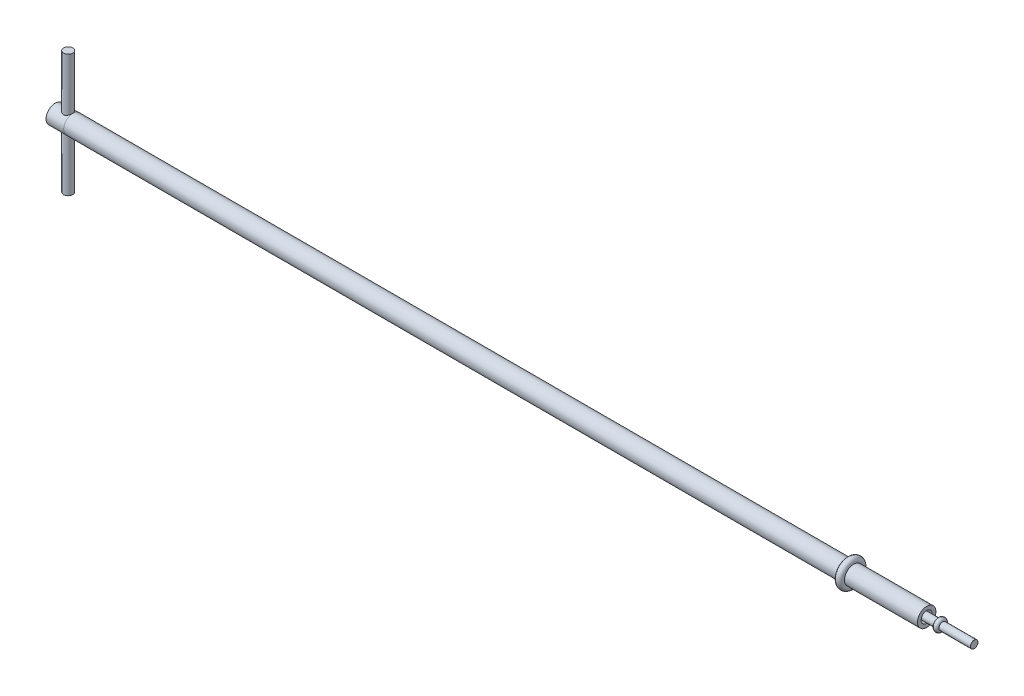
ISO-10303-21;
HEADER;
FILE_DESCRIPTION(('STEP AP214'),'2;1');
FILE_NAME('part.step','',(''),(''),'','','');
FILE_SCHEMA(('AUTOMOTIVE_DESIGN { 1 0 10303 214 1 1 1 1 }'));
ENDSEC;
DATA;
#1=APPLICATION_CONTEXT('core data for automotive mechanical design processes');
#2=APPLICATION_PROTOCOL_DEFINITION('international standard','automotive_design',2000,#1);
#3=PRODUCT_CONTEXT('',#1,'mechanical');
#4=PRODUCT('Part','Part','',(#3));
#5=PRODUCT_RELATED_PRODUCT_CATEGORY('part','',(#4));
#6=PRODUCT_DEFINITION_FORMATION('','',#4);
#7=PRODUCT_DEFINITION_CONTEXT('part definition',#1,'design');
#8=PRODUCT_DEFINITION('design','',#6,#7);
#9=PRODUCT_DEFINITION_SHAPE('','',#8);
#10=(LENGTH_UNIT() NAMED_UNIT(*) SI_UNIT(.MILLI.,.METRE.));
#11=(NAMED_UNIT(*) PLANE_ANGLE_UNIT() SI_UNIT($,.RADIAN.));
#12=(NAMED_UNIT(*) SI_UNIT($,.STERADIAN.) SOLID_ANGLE_UNIT());
#13=UNCERTAINTY_MEASURE_WITH_UNIT(LENGTH_MEASURE(1.E-05),#10,'distance_accuracy_value','');
#14=(GEOMETRIC_REPRESENTATION_CONTEXT(3) GLOBAL_UNCERTAINTY_ASSIGNED_CONTEXT((#13)) GLOBAL_UNIT_ASSIGNED_CONTEXT((#10,
#11,#12)) REPRESENTATION_CONTEXT('',''));
#15=CARTESIAN_POINT('',(0.,0.,0.));
#16=DIRECTION('',(0.,0.,1.));
#17=DIRECTION('',(1.,0.,0.));
#18=AXIS2_PLACEMENT_3D('',#15,#16,#17);
#19=CARTESIAN_POINT('',(0.,0.,0.));
#20=DIRECTION('',(1.,0.,0.));
#21=DIRECTION('',(0.,0.,-1.));
#22=AXIS2_PLACEMENT_3D('',#19,#20,#21);
#23=PLANE('',#22);
#24=CARTESIAN_POINT('',(0.,0.,0.));
#25=DIRECTION('',(-1.,0.,0.));
#26=DIRECTION('',(0.,0.,1.));
#27=AXIS2_PLACEMENT_3D('',#24,#25,#26);
#28=CIRCLE('',#27,2.96848884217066);
#29=CARTESIAN_POINT('',(0.,0.,2.96848884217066));
#30=VERTEX_POINT('',#29);
#31=EDGE_CURVE('E9',#30,#30,#28,.T.);
#32=ORIENTED_EDGE('',*,*,#31,.T.);
#33=EDGE_LOOP('',(#32));
#34=FACE_BOUND('',#33,.T.);
#35=ADVANCED_FACE('F14',(#34),#23,.F.);
#36=CARTESIAN_POINT('',(0.,0.,0.));
#37=DIRECTION('',(-1.,0.,0.));
#38=DIRECTION('',(0.,0.,1.));
#39=AXIS2_PLACEMENT_3D('',#36,#37,#38);
#40=CYLINDRICAL_SURFACE('',#39,2.96848884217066);
#41=CARTESIAN_POINT('',(4.2661907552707,-2.56162565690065,1.5));
#42=CARTESIAN_POINT('',(4.34422264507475,-2.56163267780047,1.4999944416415));
#43=CARTESIAN_POINT('',(4.42235011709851,-2.5652455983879,1.49387019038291));
#44=CARTESIAN_POINT('',(4.57619660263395,-2.57917019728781,1.46969018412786));
#45=CARTESIAN_POINT('',(4.65191032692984,-2.58949565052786,1.45160989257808));
#46=CARTESIAN_POINT('',(4.7984121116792,-2.61534051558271,1.40450365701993));
#47=CARTESIAN_POINT('',(4.86922439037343,-2.63083180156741,1.37553687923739));
#48=CARTESIAN_POINT('',(5.00496574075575,-2.66521903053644,1.3076607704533));
#49=CARTESIAN_POINT('',(5.06989438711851,-2.68411521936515,1.26875072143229));
#50=CARTESIAN_POINT('',(5.1980701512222,-2.72512943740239,1.17824574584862));
#51=CARTESIAN_POINT('',(5.26071360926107,-2.74738478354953,1.12585775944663));
#52=CARTESIAN_POINT('',(5.37679616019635,-2.79150219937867,1.01153200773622));
#53=CARTESIAN_POINT('',(5.43023057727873,-2.81336406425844,0.949589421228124));
#54=CARTESIAN_POINT('',(5.53000027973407,-2.85604040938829,0.812675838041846));
#55=CARTESIAN_POINT('',(5.57558830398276,-2.87667768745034,0.737099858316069));
#56=CARTESIAN_POINT('',(5.65312694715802,-2.91278858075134,0.57811281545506));
#57=CARTESIAN_POINT('',(5.68508635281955,-2.92826552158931,0.494706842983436));
#58=CARTESIAN_POINT('',(5.73205409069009,-2.95132082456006,0.328826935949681));
#59=CARTESIAN_POINT('',(5.74812234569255,-2.95939000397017,0.246722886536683));
#60=CARTESIAN_POINT('',(5.76634693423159,-2.96855664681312,0.0806187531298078));
#61=CARTESIAN_POINT('',(5.76851189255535,-2.96965843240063,-0.00338012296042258));
#62=CARTESIAN_POINT('',(5.75926674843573,-2.96499461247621,-0.162900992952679));
#63=CARTESIAN_POINT('',(5.74904466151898,-2.95982995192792,-0.238513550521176));
#64=CARTESIAN_POINT('',(5.71744812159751,-2.94412744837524,-0.386779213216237));
#65=CARTESIAN_POINT('',(5.69607283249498,-2.93358920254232,-0.459432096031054));
#66=CARTESIAN_POINT('',(5.64265046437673,-2.90792243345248,-0.600967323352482));
#67=CARTESIAN_POINT('',(5.6104622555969,-2.89273345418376,-0.669784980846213));
#68=CARTESIAN_POINT('',(5.53652935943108,-2.85912624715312,-0.801205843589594));
#69=CARTESIAN_POINT('',(5.49478127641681,-2.84070687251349,-0.863806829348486));
#70=CARTESIAN_POINT('',(5.39831355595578,-2.80027310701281,-0.987431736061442));
#71=CARTESIAN_POINT('',(5.34273339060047,-2.77808334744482,-1.04772730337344));
#72=CARTESIAN_POINT('',(5.22247589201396,-2.73373058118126,-1.15853905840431));
#73=CARTESIAN_POINT('',(5.15779137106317,-2.711567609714,-1.20904744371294));
#74=CARTESIAN_POINT('',(5.01595350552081,-2.66818702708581,-1.30211863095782));
#75=CARTESIAN_POINT('',(4.93825943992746,-2.64712790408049,-1.34393869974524));
#76=CARTESIAN_POINT('',(4.77563373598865,-2.61059724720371,-1.41360191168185));
#77=CARTESIAN_POINT('',(4.69070988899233,-2.59511979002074,-1.44145988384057));
#78=CARTESIAN_POINT('',(4.52314660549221,-2.5732516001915,-1.48012245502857));
#79=CARTESIAN_POINT('',(4.44086504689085,-2.5662346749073,-1.4921098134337));
#80=CARTESIAN_POINT('',(4.27518725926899,-2.56030791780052,-1.50226241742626));
#81=CARTESIAN_POINT('',(4.19179190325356,-2.56139207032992,-1.50043791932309));
#82=CARTESIAN_POINT('',(4.0363004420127,-2.57088003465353,-1.48410429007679));
#83=CARTESIAN_POINT('',(3.96399155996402,-2.57844372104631,-1.47105036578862));
#84=CARTESIAN_POINT('',(3.82273455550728,-2.5987858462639,-1.43480545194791));
#85=CARTESIAN_POINT('',(3.75378756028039,-2.61156602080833,-1.4116110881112));
#86=CARTESIAN_POINT('',(3.61758262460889,-2.64158935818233,-1.35462537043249));
#87=CARTESIAN_POINT('',(3.55054962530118,-2.65901132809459,-1.32039421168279));
#88=CARTESIAN_POINT('',(3.4227891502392,-2.69620279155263,-1.24268708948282));
#89=CARTESIAN_POINT('',(3.36206494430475,-2.71597349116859,-1.19920636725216));
#90=CARTESIAN_POINT('',(3.24042974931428,-2.75870627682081,-1.09766735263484));
#91=CARTESIAN_POINT('',(3.18050972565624,-2.78175048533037,-1.03845113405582));
#92=CARTESIAN_POINT('',(3.07113715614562,-2.82623083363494,-0.910458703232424));
#93=CARTESIAN_POINT('',(3.02168838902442,-2.84766639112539,-0.841679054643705));
#94=CARTESIAN_POINT('',(2.93345142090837,-2.88730330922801,-0.693843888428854));
#95=CARTESIAN_POINT('',(2.89500808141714,-2.90539479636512,-0.61455096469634));
#96=CARTESIAN_POINT('',(2.83239387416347,-2.93546253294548,-0.449446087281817));
#97=CARTESIAN_POINT('',(2.80821021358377,-2.94744426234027,-0.363640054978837));
#98=CARTESIAN_POINT('',(2.77692709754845,-2.96305064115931,-0.196555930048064));
#99=CARTESIAN_POINT('',(2.76844828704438,-2.96734871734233,-0.115598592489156));
#100=CARTESIAN_POINT('',(2.76472481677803,-2.96922900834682,0.046686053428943));
#101=CARTESIAN_POINT('',(2.76947531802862,-2.96681367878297,0.128013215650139));
#102=CARTESIAN_POINT('',(2.79117351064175,-2.95593044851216,0.282881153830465));
#103=CARTESIAN_POINT('',(2.80726716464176,-2.94788661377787,0.356574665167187));
#104=CARTESIAN_POINT('',(2.8500269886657,-2.92696073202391,0.500089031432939));
#105=CARTESIAN_POINT('',(2.87669464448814,-2.91407800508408,0.569909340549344));
#106=CARTESIAN_POINT('',(2.94100554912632,-2.88395591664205,0.70700699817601));
#107=CARTESIAN_POINT('',(2.97906392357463,-2.86655585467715,0.774053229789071));
#108=CARTESIAN_POINT('',(3.06455784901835,-2.82919949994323,0.901081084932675));
#109=CARTESIAN_POINT('',(3.11199768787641,-2.80924203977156,0.961059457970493));
#110=CARTESIAN_POINT('',(3.2204757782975,-2.76635443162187,1.0786621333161));
#111=CARTESIAN_POINT('',(3.28240495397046,-2.74332800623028,1.13543169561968));
#112=CARTESIAN_POINT('',(3.41521608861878,-2.69855126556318,1.23810027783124));
#113=CARTESIAN_POINT('',(3.48610617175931,-2.67680213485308,1.28398932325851));
#114=CARTESIAN_POINT('',(3.63807370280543,-2.63645767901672,1.36496837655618));
#115=CARTESIAN_POINT('',(3.71942032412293,-2.61799889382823,1.39962566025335));
#116=CARTESIAN_POINT('',(3.88798624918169,-2.5880823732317,1.45421765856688));
#117=CARTESIAN_POINT('',(3.97518486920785,-2.57660128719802,1.47420152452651));
#118=CARTESIAN_POINT('',(4.09717142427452,-2.56697512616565,1.49083314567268));
#119=CARTESIAN_POINT('',(4.13084530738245,-2.56497652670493,1.49426512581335));
#120=CARTESIAN_POINT('',(4.1984036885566,-2.56230022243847,1.49884983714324));
#121=CARTESIAN_POINT('',(4.23228820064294,-2.56162260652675,1.50000241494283));
#122=CARTESIAN_POINT('',(4.2661907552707,-2.56162565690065,1.5));
#123=B_SPLINE_CURVE_WITH_KNOTS('',3,(#41,#42,#43,#44,#45,#46,#47,#48,#49,#50,#51,#52,#53,#54,
#55,#56,#57,#58,#59,#60,#61,#62,#63,#64,#65,#66,#67,#68,#69,#70,#71,#72,#73,#74,#75,#76,#77,#78,
#79,#80,#81,#82,#83,#84,#85,#86,#87,#88,#89,#90,#91,#92,#93,#94,#95,#96,#97,#98,#99,#100,#101,
#102,#103,#104,#105,#106,#107,#108,#109,#110,#111,#112,#113,#114,#115,#116,#117,#118,#119,#120,
#121,#122),.UNSPECIFIED.,.T.,.F.,(4,2,2,2,2,2,2,2,2,2,2,2,2,2,2,2,2,2,2,2,2,2,2,2,2,2,2,2,2,2,2,
2,2,2,2,2,2,2,2,2,4),(0.,0.233952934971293,0.468387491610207,0.701565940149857,
0.934761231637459,1.18762397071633,1.44061472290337,1.71111458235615,1.98143977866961,
2.2321892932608,2.48278324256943,2.71113163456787,2.93949714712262,3.17096723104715,
3.40251966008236,3.65630154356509,3.91028491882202,4.18100181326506,4.45143056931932,
4.70029410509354,4.94897285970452,5.16957851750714,5.39025763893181,5.62112511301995,
5.85211165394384,6.11296325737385,6.37390883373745,6.64230820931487,6.91046642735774,
7.15369256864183,7.39682975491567,7.62338321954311,7.84996852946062,8.08610136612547,
8.32234237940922,8.58252752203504,8.8429502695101,9.1124607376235,9.38106425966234,
9.48270307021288,9.58434872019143),.UNSPECIFIED.);
#124=CARTESIAN_POINT('',(4.2661907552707,-2.56162565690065,1.5));
#125=VERTEX_POINT('',#124);
#126=EDGE_CURVE('E17',#125,#125,#123,.T.);
#127=ORIENTED_EDGE('',*,*,#126,.T.);
#128=EDGE_LOOP('',(#127));
#129=FACE_BOUND('',#128,.T.);
#130=CARTESIAN_POINT('',(4.2661907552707,2.56162565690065,1.5));
#131=CARTESIAN_POINT('',(4.18815886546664,2.56163267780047,1.4999944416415));
#132=CARTESIAN_POINT('',(4.11003139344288,2.5652455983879,1.49387019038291));
#133=CARTESIAN_POINT('',(3.95618490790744,2.57917019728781,1.46969018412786));
#134=CARTESIAN_POINT('',(3.88047118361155,2.58949565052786,1.45160989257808));
#135=CARTESIAN_POINT('',(3.73396939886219,2.61534051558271,1.40450365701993));
#136=CARTESIAN_POINT('',(3.66315712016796,2.63083180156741,1.37553687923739));
#137=CARTESIAN_POINT('',(3.52741576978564,2.66521903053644,1.3076607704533));
#138=CARTESIAN_POINT('',(3.46248712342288,2.68411521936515,1.26875072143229));
#139=CARTESIAN_POINT('',(3.33431135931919,2.72512943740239,1.17824574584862));
#140=CARTESIAN_POINT('',(3.27166790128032,2.74738478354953,1.12585775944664));
#141=CARTESIAN_POINT('',(3.15558535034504,2.79150219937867,1.01153200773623));
#142=CARTESIAN_POINT('',(3.10215093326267,2.81336406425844,0.949589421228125));
#143=CARTESIAN_POINT('',(3.00238123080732,2.85604040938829,0.812675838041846));
#144=CARTESIAN_POINT('',(2.95679320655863,2.87667768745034,0.73709985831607));
#145=CARTESIAN_POINT('',(2.87925456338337,2.91278858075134,0.578112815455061));
#146=CARTESIAN_POINT('',(2.84729515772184,2.92826552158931,0.494706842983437));
#147=CARTESIAN_POINT('',(2.8003274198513,2.95132082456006,0.328826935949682));
#148=CARTESIAN_POINT('',(2.78425916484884,2.95939000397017,0.246722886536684));
#149=CARTESIAN_POINT('',(2.7660345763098,2.96855664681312,0.0806187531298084));
#150=CARTESIAN_POINT('',(2.76386961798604,2.96965843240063,-0.00338012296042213));
#151=CARTESIAN_POINT('',(2.77311476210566,2.96499461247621,-0.162900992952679));
#152=CARTESIAN_POINT('',(2.78333684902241,2.95982995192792,-0.238513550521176));
#153=CARTESIAN_POINT('',(2.81493338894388,2.94412744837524,-0.386779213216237));
#154=CARTESIAN_POINT('',(2.83630867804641,2.93358920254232,-0.459432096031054));
#155=CARTESIAN_POINT('',(2.88973104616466,2.90792243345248,-0.600967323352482));
#156=CARTESIAN_POINT('',(2.92191925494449,2.89273345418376,-0.669784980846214));
#157=CARTESIAN_POINT('',(2.99585215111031,2.85912624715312,-0.801205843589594));
#158=CARTESIAN_POINT('',(3.03760023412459,2.84070687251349,-0.863806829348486));
#159=CARTESIAN_POINT('',(3.13406795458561,2.80027310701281,-0.987431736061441));
#160=CARTESIAN_POINT('',(3.18964811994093,2.77808334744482,-1.04772730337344));
#161=CARTESIAN_POINT('',(3.30990561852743,2.73373058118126,-1.15853905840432));
#162=CARTESIAN_POINT('',(3.37459013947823,2.711567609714,-1.20904744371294));
#163=CARTESIAN_POINT('',(3.51642800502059,2.66818702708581,-1.30211863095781));
#164=CARTESIAN_POINT('',(3.59412207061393,2.64712790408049,-1.34393869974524));
#165=CARTESIAN_POINT('',(3.75674777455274,2.6105972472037,-1.41360191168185));
#166=CARTESIAN_POINT('',(3.84167162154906,2.59511979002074,-1.44145988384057));
#167=CARTESIAN_POINT('',(4.00923490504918,2.5732516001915,-1.48012245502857));
#168=CARTESIAN_POINT('',(4.09151646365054,2.5662346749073,-1.4921098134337));
#169=CARTESIAN_POINT('',(4.2571942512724,2.56030791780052,-1.50226241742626));
#170=CARTESIAN_POINT('',(4.34058960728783,2.56139207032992,-1.50043791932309));
#171=CARTESIAN_POINT('',(4.49608106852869,2.57088003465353,-1.48410429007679));
#172=CARTESIAN_POINT('',(4.56838995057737,2.57844372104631,-1.47105036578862));
#173=CARTESIAN_POINT('',(4.70964695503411,2.59878584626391,-1.43480545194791));
#174=CARTESIAN_POINT('',(4.77859395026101,2.61156602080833,-1.4116110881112));
#175=CARTESIAN_POINT('',(4.9147988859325,2.64158935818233,-1.35462537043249));
#176=CARTESIAN_POINT('',(4.98183188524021,2.65901132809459,-1.32039421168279));
#177=CARTESIAN_POINT('',(5.10959236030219,2.69620279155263,-1.24268708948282));
#178=CARTESIAN_POINT('',(5.17031656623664,2.71597349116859,-1.19920636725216));
#179=CARTESIAN_POINT('',(5.29195176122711,2.75870627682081,-1.09766735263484));
#180=CARTESIAN_POINT('',(5.35187178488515,2.78175048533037,-1.03845113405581));
#181=CARTESIAN_POINT('',(5.46124435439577,2.82623083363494,-0.910458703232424));
#182=CARTESIAN_POINT('',(5.51069312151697,2.84766639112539,-0.841679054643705));
#183=CARTESIAN_POINT('',(5.59893008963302,2.88730330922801,-0.693843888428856));
#184=CARTESIAN_POINT('',(5.63737342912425,2.90539479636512,-0.614550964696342));
#185=CARTESIAN_POINT('',(5.69998763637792,2.93546253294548,-0.449446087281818));
#186=CARTESIAN_POINT('',(5.72417129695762,2.94744426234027,-0.363640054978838));
#187=CARTESIAN_POINT('',(5.75545441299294,2.96305064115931,-0.196555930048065));
#188=CARTESIAN_POINT('',(5.76393322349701,2.96734871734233,-0.115598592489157));
#189=CARTESIAN_POINT('',(5.76765669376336,2.96922900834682,0.0466860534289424));
#190=CARTESIAN_POINT('',(5.76290619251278,2.96681367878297,0.128013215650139));
#191=CARTESIAN_POINT('',(5.74120799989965,2.95593044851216,0.282881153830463));
#192=CARTESIAN_POINT('',(5.72511434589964,2.94788661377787,0.356574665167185));
#193=CARTESIAN_POINT('',(5.68235452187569,2.92696073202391,0.500089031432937));
#194=CARTESIAN_POINT('',(5.65568686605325,2.91407800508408,0.569909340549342));
#195=CARTESIAN_POINT('',(5.59137596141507,2.88395591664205,0.707006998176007));
#196=CARTESIAN_POINT('',(5.55331758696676,2.86655585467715,0.774053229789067));
#197=CARTESIAN_POINT('',(5.46782366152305,2.82919949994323,0.901081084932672));
#198=CARTESIAN_POINT('',(5.42038382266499,2.80924203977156,0.961059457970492));
#199=CARTESIAN_POINT('',(5.3119057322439,2.76635443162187,1.0786621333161));
#200=CARTESIAN_POINT('',(5.24997655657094,2.74332800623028,1.13543169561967));
#201=CARTESIAN_POINT('',(5.11716542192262,2.69855126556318,1.23810027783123));
#202=CARTESIAN_POINT('',(5.04627533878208,2.67680213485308,1.28398932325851));
#203=CARTESIAN_POINT('',(4.89430780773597,2.63645767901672,1.36496837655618));
#204=CARTESIAN_POINT('',(4.81296118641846,2.61799889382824,1.39962566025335));
#205=CARTESIAN_POINT('',(4.6443952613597,2.5880823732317,1.45421765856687));
#206=CARTESIAN_POINT('',(4.55719664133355,2.57660128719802,1.47420152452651));
#207=CARTESIAN_POINT('',(4.43521008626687,2.56697512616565,1.49083314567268));
#208=CARTESIAN_POINT('',(4.40153620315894,2.56497652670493,1.49426512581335));
#209=CARTESIAN_POINT('',(4.33397782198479,2.56230022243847,1.49884983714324));
#210=CARTESIAN_POINT('',(4.30009330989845,2.56162260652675,1.50000241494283));
#211=CARTESIAN_POINT('',(4.2661907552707,2.56162565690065,1.5));
#212=B_SPLINE_CURVE_WITH_KNOTS('',3,(#130,#131,#132,#133,#134,#135,#136,#137,#138,#139,#140,
#141,#142,#143,#144,#145,#146,#147,#148,#149,#150,#151,#152,#153,#154,#155,#156,#157,#158,#159,
#160,#161,#162,#163,#164,#165,#166,#167,#168,#169,#170,#171,#172,#173,#174,#175,#176,#177,#178,
#179,#180,#181,#182,#183,#184,#185,#186,#187,#188,#189,#190,#191,#192,#193,#194,#195,#196,#197,
#198,#199,#200,#201,#202,#203,#204,#205,#206,#207,#208,#209,#210,#211),.UNSPECIFIED.,.T.,.F.,(4,
2,2,2,2,2,2,2,2,2,2,2,2,2,2,2,2,2,2,2,2,2,2,2,2,2,2,2,2,2,2,2,2,2,2,2,2,2,2,2,4),(0.,
0.233952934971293,0.468387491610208,0.701565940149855,0.934761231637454,1.18762397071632,
1.44061472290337,1.71111458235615,1.98143977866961,2.2321892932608,2.48278324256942,
2.71113163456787,2.93949714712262,3.17096723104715,3.40251966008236,3.65630154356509,
3.91028491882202,4.18100181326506,4.45143056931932,4.70029410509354,4.94897285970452,
5.16957851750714,5.39025763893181,5.62112511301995,5.85211165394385,6.11296325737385,
6.37390883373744,6.64230820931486,6.91046642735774,7.15369256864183,7.39682975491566,
7.62338321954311,7.84996852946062,8.08610136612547,8.32234237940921,8.58252752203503,
8.8429502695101,9.1124607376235,9.38106425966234,9.48270307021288,9.58434872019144),.UNSPECIFIED.);
#213=CARTESIAN_POINT('',(4.2661907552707,2.56162565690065,1.5));
#214=VERTEX_POINT('',#213);
#215=EDGE_CURVE('E33',#214,#214,#212,.T.);
#216=ORIENTED_EDGE('',*,*,#215,.T.);
#217=EDGE_LOOP('',(#216));
#218=FACE_BOUND('',#217,.T.);
#219=ORIENTED_EDGE('',*,*,#31,.F.);
#220=EDGE_LOOP('',(#219));
#221=FACE_BOUND('',#220,.T.);
#222=CARTESIAN_POINT('',(5.7989899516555,0.,0.));
#223=DIRECTION('',(-1.,0.,0.));
#224=DIRECTION('',(0.,0.,1.));
#225=AXIS2_PLACEMENT_3D('',#222,#223,#224);
#226=CIRCLE('',#225,2.96848884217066);
#227=CARTESIAN_POINT('',(5.7989899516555,0.,2.96848884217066));
#228=VERTEX_POINT('',#227);
#229=EDGE_CURVE('E25',#228,#228,#226,.T.);
#230=ORIENTED_EDGE('',*,*,#229,.T.);
#231=EDGE_LOOP('',(#230));
#232=FACE_BOUND('',#231,.T.);
#233=ADVANCED_FACE('F39',(#129,#218,#221,#232),#40,.T.);
#234=CARTESIAN_POINT('',(5.7989899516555,2.96848884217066,0.));
#235=DIRECTION('',(1.,0.,0.));
#236=DIRECTION('',(0.,0.,-1.));
#237=AXIS2_PLACEMENT_3D('',#234,#235,#236);
#238=PLANE('',#237);
#239=ORIENTED_EDGE('',*,*,#229,.F.);
#240=EDGE_LOOP('',(#239));
#241=FACE_BOUND('',#240,.T.);
#242=CARTESIAN_POINT('',(5.7989899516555,0.,0.));
#243=DIRECTION('',(-1.,0.,0.));
#244=DIRECTION('',(0.,0.,1.));
#245=AXIS2_PLACEMENT_3D('',#242,#243,#244);
#246=CIRCLE('',#245,3.);
#247=CARTESIAN_POINT('',(5.7989899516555,0.,3.));
#248=VERTEX_POINT('',#247);
#249=EDGE_CURVE('E30',#248,#248,#246,.T.);
#250=ORIENTED_EDGE('',*,*,#249,.T.);
#251=EDGE_LOOP('',(#250));
#252=FACE_BOUND('',#251,.T.);
#253=ADVANCED_FACE('F91',(#241,#252),#238,.F.);
#254=CARTESIAN_POINT('',(0.,0.,0.));
#255=DIRECTION('',(-1.,0.,0.));
#256=DIRECTION('',(0.,0.,1.));
#257=AXIS2_PLACEMENT_3D('',#254,#255,#256);
#258=CYLINDRICAL_SURFACE('',#257,3.);
#259=ORIENTED_EDGE('',*,*,#249,.F.);
#260=EDGE_LOOP('',(#259));
#261=FACE_BOUND('',#260,.T.);
#262=CARTESIAN_POINT('',(258.628772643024,0.,0.));
#263=DIRECTION('',(-1.,0.,0.));
#264=DIRECTION('',(0.,0.,1.));
#265=AXIS2_PLACEMENT_3D('',#262,#263,#264);
#266=CIRCLE('',#265,3.);
#267=CARTESIAN_POINT('',(258.628772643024,0.,3.));
#268=VERTEX_POINT('',#267);
#269=EDGE_CURVE('E246',#268,#268,#266,.T.);
#270=ORIENTED_EDGE('',*,*,#269,.T.);
#271=EDGE_LOOP('',(#270));
#272=FACE_BOUND('',#271,.T.);
#273=ADVANCED_FACE('F88',(#261,#272),#258,.T.);
#274=CARTESIAN_POINT('',(259.645446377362,0.,0.));
#275=DIRECTION('',(-1.,0.,0.));
#276=DIRECTION('',(0.,0.,1.));
#277=AXIS2_PLACEMENT_3D('',#274,#275,#276);
#278=TOROIDAL_SURFACE('',#277,3.45662602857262,1.11451012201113);
#279=ORIENTED_EDGE('',*,*,#269,.F.);
#280=EDGE_LOOP('',(#279));
#281=FACE_BOUND('',#280,.T.);
#282=CARTESIAN_POINT('',(260.662120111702,0.,0.));
#283=DIRECTION('',(-1.,0.,0.));
#284=DIRECTION('',(0.,0.,1.));
#285=AXIS2_PLACEMENT_3D('',#282,#283,#284);
#286=CIRCLE('',#285,3.);
#287=CARTESIAN_POINT('',(260.662120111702,0.,3.));
#288=VERTEX_POINT('',#287);
#289=EDGE_CURVE('E243',#288,#288,#286,.T.);
#290=ORIENTED_EDGE('',*,*,#289,.T.);
#291=EDGE_LOOP('',(#290));
#292=FACE_BOUND('',#291,.T.);
#293=ADVANCED_FACE('F84',(#281,#292),#278,.T.);
#294=CARTESIAN_POINT('',(0.,0.,0.));
#295=DIRECTION('',(-1.,0.,0.));
#296=DIRECTION('',(0.,0.,1.));
#297=AXIS2_PLACEMENT_3D('',#294,#295,#296);
#298=CYLINDRICAL_SURFACE('',#297,3.);
#299=ORIENTED_EDGE('',*,*,#289,.F.);
#300=EDGE_LOOP('',(#299));
#301=FACE_BOUND('',#300,.T.);
#302=CARTESIAN_POINT('',(284.483646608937,0.,0.));
#303=DIRECTION('',(-1.,0.,0.));
#304=DIRECTION('',(0.,0.,1.));
#305=AXIS2_PLACEMENT_3D('',#302,#303,#304);
#306=CIRCLE('',#305,3.);
#307=CARTESIAN_POINT('',(284.483646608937,0.,3.));
#308=VERTEX_POINT('',#307);
#309=EDGE_CURVE('E240',#308,#308,#306,.T.);
#310=ORIENTED_EDGE('',*,*,#309,.T.);
#311=EDGE_LOOP('',(#310));
#312=FACE_BOUND('',#311,.T.);
#313=ADVANCED_FACE('F80',(#301,#312),#298,.T.);
#314=CARTESIAN_POINT('',(284.483646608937,3.,0.));
#315=DIRECTION('',(-1.,0.,0.));
#316=DIRECTION('',(0.,0.,1.));
#317=AXIS2_PLACEMENT_3D('',#314,#315,#316);
#318=PLANE('',#317);
#319=ORIENTED_EDGE('',*,*,#309,.F.);
#320=EDGE_LOOP('',(#319));
#321=FACE_BOUND('',#320,.T.);
#322=CARTESIAN_POINT('',(284.483646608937,0.,0.));
#323=DIRECTION('',(-1.,0.,0.));
#324=DIRECTION('',(0.,0.,1.));
#325=AXIS2_PLACEMENT_3D('',#322,#323,#324);
#326=CIRCLE('',#325,1.81549285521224);
#327=CARTESIAN_POINT('',(284.483646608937,0.,1.81549285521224));
#328=VERTEX_POINT('',#327);
#329=EDGE_CURVE('E237',#328,#328,#326,.T.);
#330=ORIENTED_EDGE('',*,*,#329,.T.);
#331=EDGE_LOOP('',(#330));
#332=FACE_BOUND('',#331,.T.);
#333=ADVANCED_FACE('F76',(#321,#332),#318,.F.);
#334=CARTESIAN_POINT('',(0.,0.,0.));
#335=DIRECTION('',(-1.,0.,0.));
#336=DIRECTION('',(0.,0.,1.));
#337=AXIS2_PLACEMENT_3D('',#334,#335,#336);
#338=CYLINDRICAL_SURFACE('',#337,1.81549285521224);
#339=ORIENTED_EDGE('',*,*,#329,.F.);
#340=EDGE_LOOP('',(#339));
#341=FACE_BOUND('',#340,.T.);
#342=CARTESIAN_POINT('',(280.736974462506,0.,0.));
#343=DIRECTION('',(-1.,0.,0.));
#344=DIRECTION('',(0.,0.,1.));
#345=AXIS2_PLACEMENT_3D('',#342,#343,#344);
#346=CIRCLE('',#345,1.81549285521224);
#347=CARTESIAN_POINT('',(280.736974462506,0.,1.81549285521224));
#348=VERTEX_POINT('',#347);
#349=EDGE_CURVE('E234',#348,#348,#346,.T.);
#350=ORIENTED_EDGE('',*,*,#349,.T.);
#351=EDGE_LOOP('',(#350));
#352=FACE_BOUND('',#351,.T.);
#353=ADVANCED_FACE('F72',(#341,#352),#338,.F.);
#354=CARTESIAN_POINT('',(280.736974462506,1.81549285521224,0.));
#355=DIRECTION('',(-1.,0.,0.));
#356=DIRECTION('',(0.,0.,1.));
#357=AXIS2_PLACEMENT_3D('',#354,#355,#356);
#358=PLANE('',#357);
#359=ORIENTED_EDGE('',*,*,#349,.F.);
#360=EDGE_LOOP('',(#359));
#361=FACE_BOUND('',#360,.T.);
#362=CARTESIAN_POINT('',(280.736974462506,0.,0.));
#363=DIRECTION('',(-1.,0.,0.));
#364=DIRECTION('',(0.,0.,1.));
#365=AXIS2_PLACEMENT_3D('',#362,#363,#364);
#366=CIRCLE('',#365,1.23252251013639);
#367=CARTESIAN_POINT('',(280.736974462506,0.,1.23252251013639));
#368=VERTEX_POINT('',#367);
#369=EDGE_CURVE('E231',#368,#368,#366,.T.);
#370=ORIENTED_EDGE('',*,*,#369,.T.);
#371=EDGE_LOOP('',(#370));
#372=FACE_BOUND('',#371,.T.);
#373=ADVANCED_FACE('F68',(#361,#372),#358,.F.);
#374=CARTESIAN_POINT('',(0.,0.,0.));
#375=DIRECTION('',(-1.,0.,0.));
#376=DIRECTION('',(0.,0.,1.));
#377=AXIS2_PLACEMENT_3D('',#374,#375,#376);
#378=CYLINDRICAL_SURFACE('',#377,1.23252251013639);
#379=ORIENTED_EDGE('',*,*,#369,.F.);
#380=EDGE_LOOP('',(#379));
#381=FACE_BOUND('',#380,.T.);
#382=CARTESIAN_POINT('',(288.128988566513,0.,0.));
#383=DIRECTION('',(-1.,0.,0.));
#384=DIRECTION('',(0.,0.,1.));
#385=AXIS2_PLACEMENT_3D('',#382,#383,#384);
#386=CIRCLE('',#385,1.23252251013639);
#387=CARTESIAN_POINT('',(288.128988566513,0.,1.23252251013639));
#388=VERTEX_POINT('',#387);
#389=EDGE_CURVE('E228',#388,#388,#386,.T.);
#390=ORIENTED_EDGE('',*,*,#389,.T.);
#391=EDGE_LOOP('',(#390));
#392=FACE_BOUND('',#391,.T.);
#393=ADVANCED_FACE('F64',(#381,#392),#378,.T.);
#394=CARTESIAN_POINT('',(288.919773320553,0.,0.));
#395=DIRECTION('',(-1.,0.,0.));
#396=DIRECTION('',(0.,0.,1.));
#397=AXIS2_PLACEMENT_3D('',#394,#395,#396);
#398=TOROIDAL_SURFACE('',#397,1.23252251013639,0.79078475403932);
#399=ORIENTED_EDGE('',*,*,#389,.F.);
#400=EDGE_LOOP('',(#399));
#401=FACE_BOUND('',#400,.T.);
#402=CARTESIAN_POINT('',(289.710558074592,0.,0.));
#403=DIRECTION('',(-1.,0.,0.));
#404=DIRECTION('',(0.,0.,1.));
#405=AXIS2_PLACEMENT_3D('',#402,#403,#404);
#406=CIRCLE('',#405,1.23252251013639);
#407=CARTESIAN_POINT('',(289.710558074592,0.,1.23252251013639));
#408=VERTEX_POINT('',#407);
#409=EDGE_CURVE('E225',#408,#408,#406,.T.);
#410=ORIENTED_EDGE('',*,*,#409,.T.);
#411=EDGE_LOOP('',(#410));
#412=FACE_BOUND('',#411,.T.);
#413=ADVANCED_FACE('F60',(#401,#412),#398,.T.);
#414=CARTESIAN_POINT('',(0.,0.,0.));
#415=DIRECTION('',(-1.,0.,0.));
#416=DIRECTION('',(0.,0.,1.));
#417=AXIS2_PLACEMENT_3D('',#414,#415,#416);
#418=CYLINDRICAL_SURFACE('',#417,1.23252251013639);
#419=ORIENTED_EDGE('',*,*,#409,.F.);
#420=EDGE_LOOP('',(#419));
#421=FACE_BOUND('',#420,.T.);
#422=CARTESIAN_POINT('',(300.,0.,0.));
#423=DIRECTION('',(-1.,0.,0.));
#424=DIRECTION('',(0.,0.,1.));
#425=AXIS2_PLACEMENT_3D('',#422,#423,#424);
#426=CIRCLE('',#425,1.23252251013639);
#427=CARTESIAN_POINT('',(300.,0.,1.23252251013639));
#428=VERTEX_POINT('',#427);
#429=EDGE_CURVE('E222',#428,#428,#426,.T.);
#430=ORIENTED_EDGE('',*,*,#429,.T.);
#431=EDGE_LOOP('',(#430));
#432=FACE_BOUND('',#431,.T.);
#433=ADVANCED_FACE('F56',(#421,#432),#418,.T.);
#434=CARTESIAN_POINT('',(300.,1.23252251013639,0.));
#435=DIRECTION('',(-1.,0.,0.));
#436=DIRECTION('',(0.,0.,1.));
#437=AXIS2_PLACEMENT_3D('',#434,#435,#436);
#438=PLANE('',#437);
#439=ORIENTED_EDGE('',*,*,#429,.F.);
#440=EDGE_LOOP('',(#439));
#441=FACE_BOUND('',#440,.T.);
#442=ADVANCED_FACE('F51',(#441),#438,.F.);
#443=CARTESIAN_POINT('',(4.2661907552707,20.,0.));
#444=DIRECTION('',(0.,1.,0.));
#445=DIRECTION('',(0.,0.,1.));
#446=AXIS2_PLACEMENT_3D('',#443,#444,#445);
#447=PLANE('',#446);
#448=CARTESIAN_POINT('',(4.2661907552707,20.,0.));
#449=DIRECTION('',(0.,1.,0.));
#450=DIRECTION('',(0.,0.,1.));
#451=AXIS2_PLACEMENT_3D('',#448,#449,#450);
#452=CIRCLE('',#451,1.5);
#453=CARTESIAN_POINT('',(4.2661907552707,20.,1.5));
#454=VERTEX_POINT('',#453);
#455=EDGE_CURVE('E217',#454,#454,#452,.T.);
#456=ORIENTED_EDGE('',*,*,#455,.T.);
#457=EDGE_LOOP('',(#456));
#458=FACE_BOUND('',#457,.T.);
#459=ADVANCED_FACE('F55',(#458),#447,.T.);
#460=CARTESIAN_POINT('',(4.2661907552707,-20.,0.));
#461=DIRECTION('',(0.,1.,0.));
#462=DIRECTION('',(0.,0.,1.));
#463=AXIS2_PLACEMENT_3D('',#460,#461,#462);
#464=CYLINDRICAL_SURFACE('',#463,1.5);
#465=ORIENTED_EDGE('',*,*,#455,.F.);
#466=EDGE_LOOP('',(#465));
#467=FACE_BOUND('',#466,.T.);
#468=ORIENTED_EDGE('',*,*,#215,.F.);
#469=EDGE_LOOP('',(#468));
#470=FACE_BOUND('',#469,.T.);
#471=ADVANCED_FACE('F48',(#467,#470),#464,.T.);
#472=CARTESIAN_POINT('',(4.2661907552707,-20.,0.));
#473=DIRECTION('',(0.,1.,0.));
#474=DIRECTION('',(0.,0.,1.));
#475=AXIS2_PLACEMENT_3D('',#472,#473,#474);
#476=CIRCLE('',#475,1.5);
#477=CARTESIAN_POINT('',(4.2661907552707,-20.,1.5));
#478=VERTEX_POINT('',#477);
#479=EDGE_CURVE('E38',#478,#478,#476,.T.);
#480=ORIENTED_EDGE('',*,*,#479,.T.);
#481=EDGE_LOOP('',(#480));
#482=FACE_BOUND('',#481,.T.);
#483=ORIENTED_EDGE('',*,*,#126,.F.);
#484=EDGE_LOOP('',(#483));
#485=FACE_BOUND('',#484,.T.);
#486=ADVANCED_FACE('F42',(#482,#485),#464,.T.);
#487=CARTESIAN_POINT('',(4.2661907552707,-20.,0.));
#488=DIRECTION('',(0.,1.,0.));
#489=DIRECTION('',(0.,0.,1.));
#490=AXIS2_PLACEMENT_3D('',#487,#488,#489);
#491=PLANE('',#490);
#492=ORIENTED_EDGE('',*,*,#479,.F.);
#493=EDGE_LOOP('',(#492));
#494=FACE_BOUND('',#493,.T.);
#495=ADVANCED_FACE('F47',(#494),#491,.F.);
#496=CLOSED_SHELL('',(#35,#233,#253,#273,#293,#313,#333,#353,#373,#393,#413,#433,#442,#459,#471,
#486,#495));
#497=MANIFOLD_SOLID_BREP('B1',#496);
#498=ADVANCED_BREP_SHAPE_REPRESENTATION('',(#18,#497),#14);
#499=SHAPE_DEFINITION_REPRESENTATION(#9,#498);
ENDSEC;
END-ISO-10303-21;
